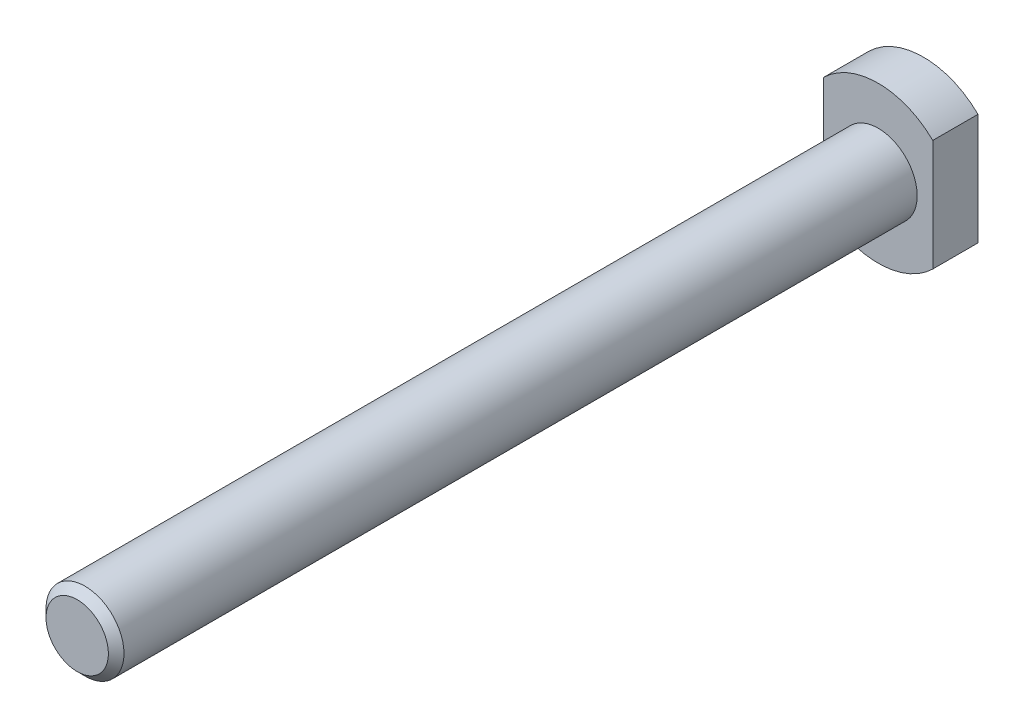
ISO-10303-21;
HEADER;
FILE_DESCRIPTION(('STEP AP214'),'2;1');
FILE_NAME('part.step','',(''),(''),'','','');
FILE_SCHEMA(('AUTOMOTIVE_DESIGN { 1 0 10303 214 1 1 1 1 }'));
ENDSEC;
DATA;
#1=APPLICATION_CONTEXT('core data for automotive mechanical design processes');
#2=APPLICATION_PROTOCOL_DEFINITION('international standard','automotive_design',2000,#1);
#3=PRODUCT_CONTEXT('',#1,'mechanical');
#4=PRODUCT('Part','Part','',(#3));
#5=PRODUCT_RELATED_PRODUCT_CATEGORY('part','',(#4));
#6=PRODUCT_DEFINITION_FORMATION('','',#4);
#7=PRODUCT_DEFINITION_CONTEXT('part definition',#1,'design');
#8=PRODUCT_DEFINITION('design','',#6,#7);
#9=PRODUCT_DEFINITION_SHAPE('','',#8);
#10=(LENGTH_UNIT() NAMED_UNIT(*) SI_UNIT(.MILLI.,.METRE.));
#11=(NAMED_UNIT(*) PLANE_ANGLE_UNIT() SI_UNIT($,.RADIAN.));
#12=(NAMED_UNIT(*) SI_UNIT($,.STERADIAN.) SOLID_ANGLE_UNIT());
#13=UNCERTAINTY_MEASURE_WITH_UNIT(LENGTH_MEASURE(1.E-05),#10,'distance_accuracy_value','');
#14=(GEOMETRIC_REPRESENTATION_CONTEXT(3) GLOBAL_UNCERTAINTY_ASSIGNED_CONTEXT((#13)) GLOBAL_UNIT_ASSIGNED_CONTEXT((#10,
#11,#12)) REPRESENTATION_CONTEXT('',''));
#15=CARTESIAN_POINT('',(0.,0.,0.));
#16=DIRECTION('',(0.,0.,1.));
#17=DIRECTION('',(1.,0.,0.));
#18=AXIS2_PLACEMENT_3D('',#15,#16,#17);
#19=CARTESIAN_POINT('',(0.,0.,5.8));
#20=DIRECTION('',(0.,0.,1.));
#21=DIRECTION('',(1.,0.,0.));
#22=AXIS2_PLACEMENT_3D('',#19,#20,#21);
#23=PLANE('',#22);
#24=CARTESIAN_POINT('',(0.,0.,5.8));
#25=DIRECTION('',(0.,0.,1.));
#26=DIRECTION('',(1.,0.,0.));
#27=AXIS2_PLACEMENT_3D('',#24,#25,#26);
#28=CIRCLE('',#27,10.);
#29=CARTESIAN_POINT('',(7.,7.14142842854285,5.8));
#30=VERTEX_POINT('',#29);
#31=CARTESIAN_POINT('',(-7.,7.14142842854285,5.8));
#32=VERTEX_POINT('',#31);
#33=EDGE_CURVE('E85',#30,#32,#28,.T.);
#34=ORIENTED_EDGE('',*,*,#33,.T.);
#35=DIRECTION('',(0.,-1.,0.));
#36=VECTOR('',#35,1.);
#37=CARTESIAN_POINT('',(-7.,7.14142842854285,5.8));
#38=LINE('',#37,#36);
#39=CARTESIAN_POINT('',(-7.,-7.14142842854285,5.8));
#40=VERTEX_POINT('',#39);
#41=EDGE_CURVE('E80',#32,#40,#38,.T.);
#42=ORIENTED_EDGE('',*,*,#41,.T.);
#43=CARTESIAN_POINT('',(0.,0.,5.8));
#44=DIRECTION('',(0.,0.,1.));
#45=DIRECTION('',(1.,0.,0.));
#46=AXIS2_PLACEMENT_3D('',#43,#44,#45);
#47=CIRCLE('',#46,10.);
#48=CARTESIAN_POINT('',(7.,-7.14142842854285,5.8));
#49=VERTEX_POINT('',#48);
#50=EDGE_CURVE('E83',#40,#49,#47,.T.);
#51=ORIENTED_EDGE('',*,*,#50,.T.);
#52=DIRECTION('',(0.,1.,0.));
#53=VECTOR('',#52,1.);
#54=CARTESIAN_POINT('',(7.,7.14142842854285,5.8));
#55=LINE('',#54,#53);
#56=EDGE_CURVE('E49',#49,#30,#55,.T.);
#57=ORIENTED_EDGE('',*,*,#56,.T.);
#58=EDGE_LOOP('',(#34,#42,#51,#57));
#59=FACE_BOUND('',#58,.T.);
#60=CARTESIAN_POINT('',(0.,0.,5.8));
#61=DIRECTION('',(0.,0.,1.));
#62=DIRECTION('',(1.,0.,0.));
#63=AXIS2_PLACEMENT_3D('',#60,#61,#62);
#64=CIRCLE('',#63,5.);
#65=CARTESIAN_POINT('',(5.,0.,5.8));
#66=VERTEX_POINT('',#65);
#67=EDGE_CURVE('E103',#66,#66,#64,.T.);
#68=ORIENTED_EDGE('',*,*,#67,.F.);
#69=EDGE_LOOP('',(#68));
#70=FACE_BOUND('',#69,.T.);
#71=ADVANCED_FACE('F32',(#59,#70),#23,.T.);
#72=CARTESIAN_POINT('',(0.,0.,5.8));
#73=DIRECTION('',(0.,0.,-1.));
#74=DIRECTION('',(-1.,0.,0.));
#75=AXIS2_PLACEMENT_3D('',#72,#73,#74);
#76=CYLINDRICAL_SURFACE('',#75,10.);
#77=CARTESIAN_POINT('',(0.,0.,0.));
#78=DIRECTION('',(0.,0.,1.));
#79=DIRECTION('',(1.,0.,0.));
#80=AXIS2_PLACEMENT_3D('',#77,#78,#79);
#81=CIRCLE('',#80,10.);
#82=CARTESIAN_POINT('',(7.,7.14142842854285,0.));
#83=VERTEX_POINT('',#82);
#84=CARTESIAN_POINT('',(-7.,7.14142842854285,0.));
#85=VERTEX_POINT('',#84);
#86=EDGE_CURVE('E100',#83,#85,#81,.T.);
#87=ORIENTED_EDGE('',*,*,#86,.T.);
#88=DIRECTION('',(0.,0.,-1.));
#89=VECTOR('',#88,1.);
#90=CARTESIAN_POINT('',(-7.,7.14142842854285,5.8));
#91=LINE('',#90,#89);
#92=EDGE_CURVE('E91',#32,#85,#91,.T.);
#93=ORIENTED_EDGE('',*,*,#92,.F.);
#94=ORIENTED_EDGE('',*,*,#33,.F.);
#95=DIRECTION('',(0.,0.,-1.));
#96=VECTOR('',#95,1.);
#97=CARTESIAN_POINT('',(7.,7.14142842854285,5.8));
#98=LINE('',#97,#96);
#99=EDGE_CURVE('E96',#30,#83,#98,.T.);
#100=ORIENTED_EDGE('',*,*,#99,.T.);
#101=EDGE_LOOP('',(#87,#93,#94,#100));
#102=FACE_BOUND('',#101,.T.);
#103=ADVANCED_FACE('F123',(#102),#76,.T.);
#104=CARTESIAN_POINT('',(-7.,7.14142842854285,5.8));
#105=DIRECTION('',(1.,0.,0.));
#106=DIRECTION('',(0.,1.,0.));
#107=AXIS2_PLACEMENT_3D('',#104,#105,#106);
#108=PLANE('',#107);
#109=DIRECTION('',(0.,-1.,0.));
#110=VECTOR('',#109,1.);
#111=CARTESIAN_POINT('',(-7.,7.14142842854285,0.));
#112=LINE('',#111,#110);
#113=CARTESIAN_POINT('',(-7.,-7.14142842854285,0.));
#114=VERTEX_POINT('',#113);
#115=EDGE_CURVE('E90',#85,#114,#112,.T.);
#116=ORIENTED_EDGE('',*,*,#115,.T.);
#117=DIRECTION('',(0.,0.,-1.));
#118=VECTOR('',#117,1.);
#119=CARTESIAN_POINT('',(-7.,-7.14142842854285,5.8));
#120=LINE('',#119,#118);
#121=EDGE_CURVE('E88',#40,#114,#120,.T.);
#122=ORIENTED_EDGE('',*,*,#121,.F.);
#123=ORIENTED_EDGE('',*,*,#41,.F.);
#124=ORIENTED_EDGE('',*,*,#92,.T.);
#125=EDGE_LOOP('',(#116,#122,#123,#124));
#126=FACE_BOUND('',#125,.T.);
#127=ADVANCED_FACE('F89',(#126),#108,.F.);
#128=CARTESIAN_POINT('',(0.,0.,5.8));
#129=DIRECTION('',(0.,0.,-1.));
#130=DIRECTION('',(-1.,0.,0.));
#131=AXIS2_PLACEMENT_3D('',#128,#129,#130);
#132=CYLINDRICAL_SURFACE('',#131,10.);
#133=CARTESIAN_POINT('',(0.,0.,0.));
#134=DIRECTION('',(0.,0.,1.));
#135=DIRECTION('',(1.,0.,0.));
#136=AXIS2_PLACEMENT_3D('',#133,#134,#135);
#137=CIRCLE('',#136,10.);
#138=CARTESIAN_POINT('',(7.,-7.14142842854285,0.));
#139=VERTEX_POINT('',#138);
#140=EDGE_CURVE('E66',#114,#139,#137,.T.);
#141=ORIENTED_EDGE('',*,*,#140,.T.);
#142=DIRECTION('',(0.,0.,-1.));
#143=VECTOR('',#142,1.);
#144=CARTESIAN_POINT('',(7.,-7.14142842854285,5.8));
#145=LINE('',#144,#143);
#146=EDGE_CURVE('E92',#49,#139,#145,.T.);
#147=ORIENTED_EDGE('',*,*,#146,.F.);
#148=ORIENTED_EDGE('',*,*,#50,.F.);
#149=ORIENTED_EDGE('',*,*,#121,.T.);
#150=EDGE_LOOP('',(#141,#147,#148,#149));
#151=FACE_BOUND('',#150,.T.);
#152=ADVANCED_FACE('F94',(#151),#132,.T.);
#153=CARTESIAN_POINT('',(7.,7.14142842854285,5.8));
#154=DIRECTION('',(-1.,0.,0.));
#155=DIRECTION('',(0.,0.,1.));
#156=AXIS2_PLACEMENT_3D('',#153,#154,#155);
#157=PLANE('',#156);
#158=DIRECTION('',(0.,1.,0.));
#159=VECTOR('',#158,1.);
#160=CARTESIAN_POINT('',(7.,7.14142842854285,0.));
#161=LINE('',#160,#159);
#162=EDGE_CURVE('E72',#139,#83,#161,.T.);
#163=ORIENTED_EDGE('',*,*,#162,.T.);
#164=ORIENTED_EDGE('',*,*,#99,.F.);
#165=ORIENTED_EDGE('',*,*,#56,.F.);
#166=ORIENTED_EDGE('',*,*,#146,.T.);
#167=EDGE_LOOP('',(#163,#164,#165,#166));
#168=FACE_BOUND('',#167,.T.);
#169=ADVANCED_FACE('F134',(#168),#157,.F.);
#170=CARTESIAN_POINT('',(0.,0.,0.));
#171=DIRECTION('',(0.,0.,1.));
#172=DIRECTION('',(1.,0.,0.));
#173=AXIS2_PLACEMENT_3D('',#170,#171,#172);
#174=PLANE('',#173);
#175=ORIENTED_EDGE('',*,*,#86,.F.);
#176=ORIENTED_EDGE('',*,*,#162,.F.);
#177=ORIENTED_EDGE('',*,*,#140,.F.);
#178=ORIENTED_EDGE('',*,*,#115,.F.);
#179=EDGE_LOOP('',(#175,#176,#177,#178));
#180=FACE_BOUND('',#179,.T.);
#181=ADVANCED_FACE('F131',(#180),#174,.F.);
#182=CARTESIAN_POINT('',(0.,0.,108.5));
#183=DIRECTION('',(0.,0.,-1.));
#184=DIRECTION('',(-1.,0.,0.));
#185=AXIS2_PLACEMENT_3D('',#182,#183,#184);
#186=CYLINDRICAL_SURFACE('',#185,5.);
#187=CARTESIAN_POINT('',(0.,0.,107.5));
#188=DIRECTION('',(0.,0.,1.));
#189=DIRECTION('',(1.,0.,0.));
#190=AXIS2_PLACEMENT_3D('',#187,#188,#189);
#191=CIRCLE('',#190,5.);
#192=CARTESIAN_POINT('',(5.,0.,107.5));
#193=VERTEX_POINT('',#192);
#194=EDGE_CURVE('E11',#193,#193,#191,.F.);
#195=ORIENTED_EDGE('',*,*,#194,.T.);
#196=EDGE_LOOP('',(#195));
#197=FACE_BOUND('',#196,.T.);
#198=ORIENTED_EDGE('',*,*,#67,.T.);
#199=EDGE_LOOP('',(#198));
#200=FACE_BOUND('',#199,.T.);
#201=ADVANCED_FACE('F119',(#197,#200),#186,.T.);
#202=CARTESIAN_POINT('',(0.,0.,108.5));
#203=DIRECTION('',(0.,0.,1.));
#204=DIRECTION('',(1.,0.,0.));
#205=AXIS2_PLACEMENT_3D('',#202,#203,#204);
#206=PLANE('',#205);
#207=CARTESIAN_POINT('',(0.,0.,108.5));
#208=DIRECTION('',(0.,0.,1.));
#209=DIRECTION('',(1.,0.,0.));
#210=AXIS2_PLACEMENT_3D('',#207,#208,#209);
#211=CIRCLE('',#210,4.);
#212=CARTESIAN_POINT('',(4.,0.,108.5));
#213=VERTEX_POINT('',#212);
#214=EDGE_CURVE('E41',#213,#213,#211,.T.);
#215=ORIENTED_EDGE('',*,*,#214,.T.);
#216=EDGE_LOOP('',(#215));
#217=FACE_BOUND('',#216,.T.);
#218=ADVANCED_FACE('F112',(#217),#206,.T.);
#219=CARTESIAN_POINT('',(0.,0.,108.5));
#220=DIRECTION('',(0.,0.,-1.));
#221=DIRECTION('',(-1.,0.,0.));
#222=AXIS2_PLACEMENT_3D('',#219,#220,#221);
#223=CONICAL_SURFACE('',#222,4.,0.785398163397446);
#224=ORIENTED_EDGE('',*,*,#194,.F.);
#225=EDGE_LOOP('',(#224));
#226=FACE_BOUND('',#225,.T.);
#227=ORIENTED_EDGE('',*,*,#214,.F.);
#228=EDGE_LOOP('',(#227));
#229=FACE_BOUND('',#228,.T.);
#230=ADVANCED_FACE('F34',(#226,#229),#223,.T.);
#231=CLOSED_SHELL('',(#71,#103,#127,#152,#169,#181,#201,#218,#230));
#232=MANIFOLD_SOLID_BREP('B2',#231);
#233=ADVANCED_BREP_SHAPE_REPRESENTATION('',(#18,#232),#14);
#234=SHAPE_DEFINITION_REPRESENTATION(#9,#233);
ENDSEC;
END-ISO-10303-21;
